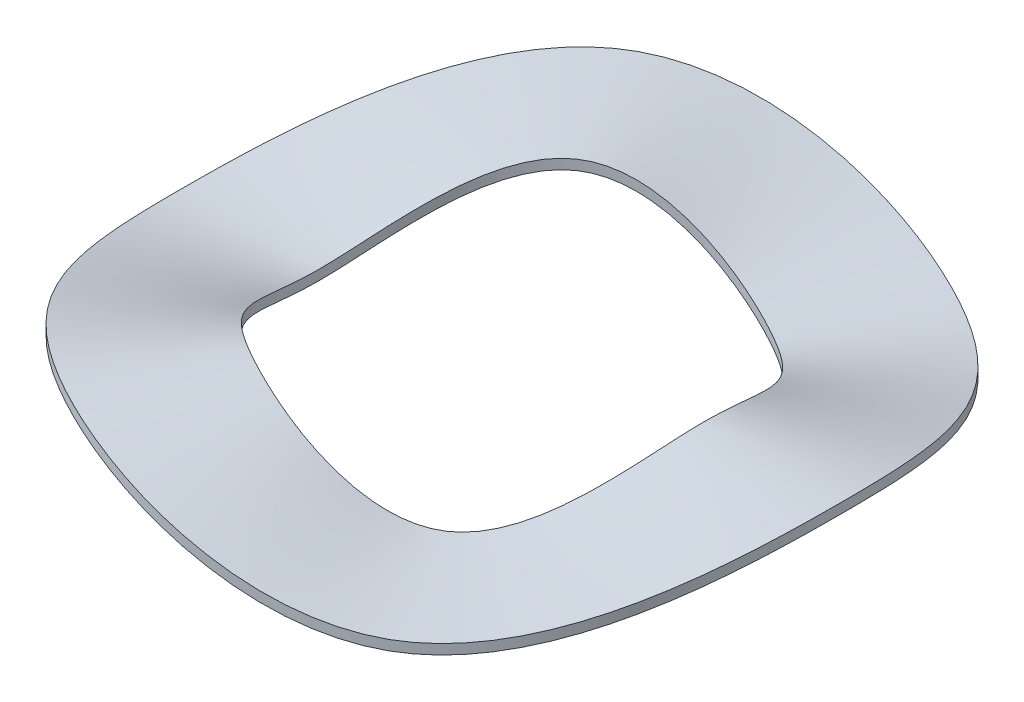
ISO-10303-21;
HEADER;
FILE_DESCRIPTION(('STEP AP214'),'2;1');
FILE_NAME('part.step','',(''),(''),'','','');
FILE_SCHEMA(('AUTOMOTIVE_DESIGN { 1 0 10303 214 1 1 1 1 }'));
ENDSEC;
DATA;
#1=APPLICATION_CONTEXT('core data for automotive mechanical design processes');
#2=APPLICATION_PROTOCOL_DEFINITION('international standard','automotive_design',2000,#1);
#3=PRODUCT_CONTEXT('',#1,'mechanical');
#4=PRODUCT('Part','Part','',(#3));
#5=PRODUCT_RELATED_PRODUCT_CATEGORY('part','',(#4));
#6=PRODUCT_DEFINITION_FORMATION('','',#4);
#7=PRODUCT_DEFINITION_CONTEXT('part definition',#1,'design');
#8=PRODUCT_DEFINITION('design','',#6,#7);
#9=PRODUCT_DEFINITION_SHAPE('','',#8);
#10=(LENGTH_UNIT() NAMED_UNIT(*) SI_UNIT(.MILLI.,.METRE.));
#11=(NAMED_UNIT(*) PLANE_ANGLE_UNIT() SI_UNIT($,.RADIAN.));
#12=(NAMED_UNIT(*) SI_UNIT($,.STERADIAN.) SOLID_ANGLE_UNIT());
#13=UNCERTAINTY_MEASURE_WITH_UNIT(LENGTH_MEASURE(1.E-05),#10,'distance_accuracy_value','');
#14=(GEOMETRIC_REPRESENTATION_CONTEXT(3) GLOBAL_UNCERTAINTY_ASSIGNED_CONTEXT((#13)) GLOBAL_UNIT_ASSIGNED_CONTEXT((#10,
#11,#12)) REPRESENTATION_CONTEXT('',''));
#15=CARTESIAN_POINT('',(0.,0.,0.));
#16=DIRECTION('',(0.,0.,1.));
#17=DIRECTION('',(1.,0.,0.));
#18=AXIS2_PLACEMENT_3D('',#15,#16,#17);
#19=CARTESIAN_POINT('',(-12.6365,0.381,0.));
#20=CARTESIAN_POINT('',(-12.636499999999,0.380999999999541,-0.218870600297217));
#21=CARTESIAN_POINT('',(-12.6238634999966,0.392302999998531,-0.656611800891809));
#22=CARTESIAN_POINT('',(-12.5679469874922,0.439775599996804,-1.31158207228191));
#23=CARTESIAN_POINT('',(-12.4760164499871,0.514375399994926,-1.96326928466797));
#24=CARTESIAN_POINT('',(-11.7140354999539,1.10439199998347,-5.84384502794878));
#25=CARTESIAN_POINT('',(-6.570979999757,4.45008000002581,-13.13223601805));
#26=CARTESIAN_POINT('',(7.58189999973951,-1.87960000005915,-13.1322360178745));
#27=CARTESIAN_POINT('',(15.163800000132,4.90219999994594,-6.70400177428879E-10));
#28=CARTESIAN_POINT('',(7.5818999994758,-1.87959999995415,13.1322360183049));
#29=CARTESIAN_POINT('',(-6.57097999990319,4.45008000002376,13.1322360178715));
#30=CARTESIAN_POINT('',(-11.7140355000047,1.10439200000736,5.8438450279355));
#31=CARTESIAN_POINT('',(-12.4760164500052,0.514375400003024,1.96326928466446));
#32=CARTESIAN_POINT('',(-12.5679469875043,0.439775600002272,1.31158207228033));
#33=CARTESIAN_POINT('',(-12.6238635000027,0.392303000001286,0.6566118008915));
#34=CARTESIAN_POINT('',(-12.636500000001,0.381000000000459,0.218870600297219));
#35=CARTESIAN_POINT('',(-12.6365,0.381,0.));
#36=CARTESIAN_POINT('',(-10.8712,0.381,0.));
#37=CARTESIAN_POINT('',(-10.8711999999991,0.380999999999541,-0.188294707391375));
#38=CARTESIAN_POINT('',(-10.8603287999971,0.392302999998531,-0.56488412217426));
#39=CARTESIAN_POINT('',(-10.8122237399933,0.439775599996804,-1.12835603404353));
#40=CARTESIAN_POINT('',(-10.7331357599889,0.514375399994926,-1.68900352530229));
#41=CARTESIAN_POINT('',(-10.0776023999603,1.10439199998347,-5.02746868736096));
#42=CARTESIAN_POINT('',(-5.65302399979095,4.45008000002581,-11.2976824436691));
#43=CARTESIAN_POINT('',(6.5227199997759,-1.87960000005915,-11.2976824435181));
#44=CARTESIAN_POINT('',(13.0454400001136,4.90219999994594,-5.76746305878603E-10));
#45=CARTESIAN_POINT('',(6.52271999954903,-1.87959999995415,11.2976824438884));
#46=CARTESIAN_POINT('',(-5.65302399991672,4.45008000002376,11.2976824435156));
#47=CARTESIAN_POINT('',(-10.077602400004,1.10439200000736,5.02746868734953));
#48=CARTESIAN_POINT('',(-10.7331357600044,0.514375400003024,1.68900352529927));
#49=CARTESIAN_POINT('',(-10.8122237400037,0.439775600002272,1.12835603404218));
#50=CARTESIAN_POINT('',(-10.8603288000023,0.392303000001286,0.564884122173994));
#51=CARTESIAN_POINT('',(-10.8712000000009,0.381000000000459,0.188294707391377));
#52=CARTESIAN_POINT('',(-10.8712,0.381,0.));
#53=CARTESIAN_POINT('',(-9.1059,0.381,0.));
#54=CARTESIAN_POINT('',(-9.10589999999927,0.380999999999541,-0.157718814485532));
#55=CARTESIAN_POINT('',(-9.09679409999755,0.392302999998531,-0.47315644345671));
#56=CARTESIAN_POINT('',(-9.05650049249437,0.439775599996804,-0.945129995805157));
#57=CARTESIAN_POINT('',(-8.99025506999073,0.514375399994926,-1.41473776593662));
#58=CARTESIAN_POINT('',(-8.44116929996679,1.10439199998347,-4.21109234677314));
#59=CARTESIAN_POINT('',(-4.73506799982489,4.45008000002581,-9.46312886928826));
#60=CARTESIAN_POINT('',(5.46353999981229,-1.87960000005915,-9.46312886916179));
#61=CARTESIAN_POINT('',(10.9270800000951,4.90219999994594,-4.83094277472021E-10));
#62=CARTESIAN_POINT('',(5.46353999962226,-1.87959999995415,9.46312886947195));
#63=CARTESIAN_POINT('',(-4.73506799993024,4.45008000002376,9.46312886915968));
#64=CARTESIAN_POINT('',(-8.44116930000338,1.10439200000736,4.21109234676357));
#65=CARTESIAN_POINT('',(-8.99025507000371,0.514375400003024,1.41473776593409));
#66=CARTESIAN_POINT('',(-9.05650049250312,0.439775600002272,0.94512999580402));
#67=CARTESIAN_POINT('',(-9.09679410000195,0.392303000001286,0.473156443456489));
#68=CARTESIAN_POINT('',(-9.10590000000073,0.381000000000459,0.157718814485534));
#69=CARTESIAN_POINT('',(-9.1059,0.381,0.));
#70=CARTESIAN_POINT('',(-7.3406,0.381,0.));
#71=CARTESIAN_POINT('',(-7.34059999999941,0.380999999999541,-0.127142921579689));
#72=CARTESIAN_POINT('',(-7.33325939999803,0.392302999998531,-0.381428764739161));
#73=CARTESIAN_POINT('',(-7.30077724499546,0.439775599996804,-0.761903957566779));
#74=CARTESIAN_POINT('',(-7.24737437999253,0.514375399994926,-1.14047200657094));
#75=CARTESIAN_POINT('',(-6.80473619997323,1.10439199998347,-3.39471600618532));
#76=CARTESIAN_POINT('',(-3.81711199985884,4.45008000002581,-7.62857529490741));
#77=CARTESIAN_POINT('',(4.40435999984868,-1.87960000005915,-7.62857529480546));
#78=CARTESIAN_POINT('',(8.80872000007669,4.90219999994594,-3.89440053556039E-10));
#79=CARTESIAN_POINT('',(4.40435999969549,-1.87959999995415,7.62857529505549));
#80=CARTESIAN_POINT('',(-3.81711199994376,4.45008000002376,7.62857529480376));
#81=CARTESIAN_POINT('',(-6.80473620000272,1.10439200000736,3.3947160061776));
#82=CARTESIAN_POINT('',(-7.247374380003,0.514375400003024,1.1404720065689));
#83=CARTESIAN_POINT('',(-7.30077724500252,0.439775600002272,0.761903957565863));
#84=CARTESIAN_POINT('',(-7.33325940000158,0.392303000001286,0.381428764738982));
#85=CARTESIAN_POINT('',(-7.3406000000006,0.381000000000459,0.127142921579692));
#86=CARTESIAN_POINT('',(-7.3406,0.381,0.));
#87=B_SPLINE_SURFACE_WITH_KNOTS('',3,3,((#19,#20,#21,#22,#23,#24,#25,#26,#27,#28,#29,#30,#31,
#32,#33,#34,#35),(#36,#37,#38,#39,#40,#41,#42,#43,#44,#45,#46,#47,#48,#49,#50,#51,#52),(#53,#54,
#55,#56,#57,#58,#59,#60,#61,#62,#63,#64,#65,#66,#67,#68,#69),(#70,#71,#72,#73,#74,#75,#76,#77,
#78,#79,#80,#81,#82,#83,#84,#85,#86)),.UNSPECIFIED.,.F.,.T.,.F.,(4,4),(4,1,1,1,1,1,1,1,1,1,1,1,
1,1,4),(0.,1.),(0.,0.0083333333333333,0.0166666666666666,0.0250000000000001,0.0333333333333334,
0.166666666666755,0.333333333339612,0.500000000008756,0.666666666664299,0.833333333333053,
0.966666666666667,0.975,0.983333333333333,0.991666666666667,1.),.UNSPECIFIED.);
#88=CARTESIAN_POINT('',(-12.6365,0.381,0.));
#89=CARTESIAN_POINT('',(-12.636499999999,0.380999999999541,-0.218870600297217));
#90=CARTESIAN_POINT('',(-12.6238634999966,0.392302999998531,-0.656611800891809));
#91=CARTESIAN_POINT('',(-12.5679469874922,0.439775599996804,-1.31158207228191));
#92=CARTESIAN_POINT('',(-12.4760164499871,0.514375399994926,-1.96326928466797));
#93=CARTESIAN_POINT('',(-11.7140354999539,1.10439199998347,-5.84384502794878));
#94=CARTESIAN_POINT('',(-6.570979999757,4.45008000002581,-13.13223601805));
#95=CARTESIAN_POINT('',(7.58189999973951,-1.87960000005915,-13.1322360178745));
#96=CARTESIAN_POINT('',(15.163800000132,4.90219999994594,-6.70400177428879E-10));
#97=CARTESIAN_POINT('',(7.5818999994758,-1.87959999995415,13.1322360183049));
#98=CARTESIAN_POINT('',(-6.57097999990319,4.45008000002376,13.1322360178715));
#99=CARTESIAN_POINT('',(-11.7140355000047,1.10439200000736,5.8438450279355));
#100=CARTESIAN_POINT('',(-12.4760164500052,0.514375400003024,1.96326928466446));
#101=CARTESIAN_POINT('',(-12.5679469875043,0.439775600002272,1.31158207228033));
#102=CARTESIAN_POINT('',(-12.6238635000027,0.392303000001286,0.6566118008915));
#103=CARTESIAN_POINT('',(-12.636500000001,0.381000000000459,0.218870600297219));
#104=CARTESIAN_POINT('',(-12.6365,0.381,0.));
#105=B_SPLINE_CURVE_WITH_KNOTS('',3,(#88,#89,#90,#91,#92,#93,#94,#95,#96,#97,#98,#99,#100,#101,
#102,#103,#104),.UNSPECIFIED.,.T.,.F.,(4,1,1,1,1,1,1,1,1,1,1,1,1,1,4),(0.,0.0083333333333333,
0.0166666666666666,0.0250000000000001,0.0333333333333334,0.166666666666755,0.333333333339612,
0.500000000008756,0.666666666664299,0.833333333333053,0.966666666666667,0.975,0.983333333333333,
0.991666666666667,1.),.UNSPECIFIED.);
#106=CARTESIAN_POINT('',(-12.6365,0.381,0.));
#107=VERTEX_POINT('',#106);
#108=EDGE_CURVE('E11',#107,#107,#105,.F.);
#109=CARTESIAN_POINT('',(-7.3406,0.381,0.));
#110=CARTESIAN_POINT('',(-7.34059999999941,0.380999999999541,-0.127142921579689));
#111=CARTESIAN_POINT('',(-7.33325939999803,0.392302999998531,-0.381428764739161));
#112=CARTESIAN_POINT('',(-7.30077724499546,0.439775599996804,-0.761903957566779));
#113=CARTESIAN_POINT('',(-7.24737437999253,0.514375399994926,-1.14047200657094));
#114=CARTESIAN_POINT('',(-6.80473619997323,1.10439199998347,-3.39471600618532));
#115=CARTESIAN_POINT('',(-3.81711199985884,4.45008000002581,-7.62857529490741));
#116=CARTESIAN_POINT('',(4.40435999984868,-1.87960000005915,-7.62857529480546));
#117=CARTESIAN_POINT('',(8.80872000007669,4.90219999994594,-3.89440053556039E-10));
#118=CARTESIAN_POINT('',(4.40435999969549,-1.87959999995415,7.62857529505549));
#119=CARTESIAN_POINT('',(-3.81711199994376,4.45008000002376,7.62857529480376));
#120=CARTESIAN_POINT('',(-6.80473620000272,1.10439200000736,3.3947160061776));
#121=CARTESIAN_POINT('',(-7.247374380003,0.514375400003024,1.1404720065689));
#122=CARTESIAN_POINT('',(-7.30077724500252,0.439775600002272,0.761903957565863));
#123=CARTESIAN_POINT('',(-7.33325940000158,0.392303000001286,0.381428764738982));
#124=CARTESIAN_POINT('',(-7.3406000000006,0.381000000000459,0.127142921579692));
#125=CARTESIAN_POINT('',(-7.3406,0.381,0.));
#126=B_SPLINE_CURVE_WITH_KNOTS('',3,(#109,#110,#111,#112,#113,#114,#115,#116,#117,#118,#119,
#120,#121,#122,#123,#124,#125),.UNSPECIFIED.,.T.,.F.,(4,1,1,1,1,1,1,1,1,1,1,1,1,1,4),(0.,
0.0083333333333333,0.0166666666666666,0.0250000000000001,0.0333333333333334,0.166666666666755,
0.333333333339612,0.500000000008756,0.666666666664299,0.833333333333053,0.966666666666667,0.975,
0.983333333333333,0.991666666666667,1.),.UNSPECIFIED.);
#127=CARTESIAN_POINT('',(-7.3406,0.381,0.));
#128=VERTEX_POINT('',#127);
#129=EDGE_CURVE('E63',#128,#128,#126,.T.);
#130=ORIENTED_EDGE('',*,*,#108,.T.);
#131=EDGE_LOOP('',(#130));
#132=FACE_BOUND('',#131,.T.);
#133=ORIENTED_EDGE('',*,*,#129,.T.);
#134=EDGE_LOOP('',(#133));
#135=FACE_BOUND('',#134,.T.);
#136=ADVANCED_FACE('F51',(#132,#135),#87,.T.);
#137=CARTESIAN_POINT('',(-12.6365,0.,0.));
#138=CARTESIAN_POINT('',(-12.636499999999,-4.59229076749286E-13,-0.218870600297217));
#139=CARTESIAN_POINT('',(-12.6238634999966,0.0113029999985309,-0.656611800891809));
#140=CARTESIAN_POINT('',(-12.5679469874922,0.0587755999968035,-1.31158207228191));
#141=CARTESIAN_POINT('',(-12.4760164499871,0.133375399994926,-1.96326928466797));
#142=CARTESIAN_POINT('',(-11.7140354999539,0.723391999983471,-5.84384502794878));
#143=CARTESIAN_POINT('',(-6.570979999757,4.06908000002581,-13.13223601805));
#144=CARTESIAN_POINT('',(7.58189999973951,-2.26060000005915,-13.1322360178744));
#145=CARTESIAN_POINT('',(15.163800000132,4.52119999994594,-6.70402264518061E-10));
#146=CARTESIAN_POINT('',(7.58189999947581,-2.26059999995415,13.1322360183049));
#147=CARTESIAN_POINT('',(-6.57097999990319,4.06908000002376,13.1322360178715));
#148=CARTESIAN_POINT('',(-11.7140355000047,0.723392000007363,5.8438450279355));
#149=CARTESIAN_POINT('',(-12.4760164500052,0.133375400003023,1.96326928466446));
#150=CARTESIAN_POINT('',(-12.5679469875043,0.0587756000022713,1.31158207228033));
#151=CARTESIAN_POINT('',(-12.6238635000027,0.0113030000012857,0.6566118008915));
#152=CARTESIAN_POINT('',(-12.636500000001,4.5902409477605E-13,0.218870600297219));
#153=CARTESIAN_POINT('',(-12.6365,0.,0.));
#154=CARTESIAN_POINT('',(-12.6365,0.03175,0.));
#155=CARTESIAN_POINT('',(-12.636499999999,0.0317499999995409,-0.218870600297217));
#156=CARTESIAN_POINT('',(-12.6238634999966,0.043052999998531,-0.656611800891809));
#157=CARTESIAN_POINT('',(-12.5679469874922,0.0905255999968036,-1.31158207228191));
#158=CARTESIAN_POINT('',(-12.4760164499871,0.165125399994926,-1.96326928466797));
#159=CARTESIAN_POINT('',(-11.7140354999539,0.755141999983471,-5.84384502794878));
#160=CARTESIAN_POINT('',(-6.570979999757,4.10083000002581,-13.13223601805));
#161=CARTESIAN_POINT('',(7.5818999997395,-2.22885000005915,-13.1322360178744));
#162=CARTESIAN_POINT('',(15.163800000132,4.55294999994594,-6.70402264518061E-10));
#163=CARTESIAN_POINT('',(7.5818999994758,-2.22884999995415,13.1322360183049));
#164=CARTESIAN_POINT('',(-6.57097999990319,4.10083000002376,13.1322360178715));
#165=CARTESIAN_POINT('',(-11.7140355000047,0.755142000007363,5.8438450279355));
#166=CARTESIAN_POINT('',(-12.4760164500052,0.165125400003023,1.96326928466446));
#167=CARTESIAN_POINT('',(-12.5679469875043,0.0905256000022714,1.31158207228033));
#168=CARTESIAN_POINT('',(-12.6238635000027,0.0430530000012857,0.6566118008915));
#169=CARTESIAN_POINT('',(-12.636500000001,0.0317500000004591,0.218870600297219));
#170=CARTESIAN_POINT('',(-12.6365,0.03175,0.));
#171=CARTESIAN_POINT('',(-12.6365,0.0952500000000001,0.));
#172=CARTESIAN_POINT('',(-12.636499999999,0.095249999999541,-0.218870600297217));
#173=CARTESIAN_POINT('',(-12.6238634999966,0.106552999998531,-0.656611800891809));
#174=CARTESIAN_POINT('',(-12.5679469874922,0.154025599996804,-1.31158207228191));
#175=CARTESIAN_POINT('',(-12.4760164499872,0.228625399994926,-1.96326928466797));
#176=CARTESIAN_POINT('',(-11.7140354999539,0.818641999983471,-5.84384502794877));
#177=CARTESIAN_POINT('',(-6.570979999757,4.16433000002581,-13.1322360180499));
#178=CARTESIAN_POINT('',(7.58189999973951,-2.16535000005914,-13.1322360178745));
#179=CARTESIAN_POINT('',(15.163800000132,4.61644999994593,-6.70398632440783E-10));
#180=CARTESIAN_POINT('',(7.58189999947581,-2.16534999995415,13.1322360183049));
#181=CARTESIAN_POINT('',(-6.5709799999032,4.16433000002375,13.1322360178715));
#182=CARTESIAN_POINT('',(-11.7140355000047,0.818642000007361,5.8438450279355));
#183=CARTESIAN_POINT('',(-12.4760164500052,0.228625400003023,1.96326928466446));
#184=CARTESIAN_POINT('',(-12.5679469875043,0.154025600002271,1.31158207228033));
#185=CARTESIAN_POINT('',(-12.6238635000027,0.106553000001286,0.6566118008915));
#186=CARTESIAN_POINT('',(-12.636500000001,0.0952500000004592,0.218870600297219));
#187=CARTESIAN_POINT('',(-12.6365,0.0952500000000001,0.));
#188=CARTESIAN_POINT('',(-12.6365,0.1905,0.));
#189=CARTESIAN_POINT('',(-12.636499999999,0.190499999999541,-0.218870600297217));
#190=CARTESIAN_POINT('',(-12.6238634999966,0.201802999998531,-0.656611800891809));
#191=CARTESIAN_POINT('',(-12.5679469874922,0.249275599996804,-1.31158207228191));
#192=CARTESIAN_POINT('',(-12.4760164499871,0.323875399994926,-1.96326928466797));
#193=CARTESIAN_POINT('',(-11.7140354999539,0.913891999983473,-5.84384502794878));
#194=CARTESIAN_POINT('',(-6.570979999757,4.25958000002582,-13.13223601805));
#195=CARTESIAN_POINT('',(7.5818999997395,-2.07010000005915,-13.1322360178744));
#196=CARTESIAN_POINT('',(15.163800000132,4.71169999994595,-6.70400949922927E-10));
#197=CARTESIAN_POINT('',(7.5818999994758,-2.07009999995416,13.1322360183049));
#198=CARTESIAN_POINT('',(-6.57097999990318,4.25958000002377,13.1322360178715));
#199=CARTESIAN_POINT('',(-11.7140355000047,0.913892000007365,5.8438450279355));
#200=CARTESIAN_POINT('',(-12.4760164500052,0.323875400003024,1.96326928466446));
#201=CARTESIAN_POINT('',(-12.5679469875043,0.249275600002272,1.31158207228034));
#202=CARTESIAN_POINT('',(-12.6238635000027,0.201803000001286,0.656611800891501));
#203=CARTESIAN_POINT('',(-12.636500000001,0.190500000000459,0.21887060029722));
#204=CARTESIAN_POINT('',(-12.6365,0.1905,0.));
#205=CARTESIAN_POINT('',(-12.6365,0.28575,0.));
#206=CARTESIAN_POINT('',(-12.636499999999,0.285749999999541,-0.218870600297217));
#207=CARTESIAN_POINT('',(-12.6238634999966,0.297052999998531,-0.656611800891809));
#208=CARTESIAN_POINT('',(-12.5679469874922,0.344525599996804,-1.31158207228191));
#209=CARTESIAN_POINT('',(-12.4760164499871,0.419125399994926,-1.96326928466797));
#210=CARTESIAN_POINT('',(-11.7140354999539,1.00914199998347,-5.84384502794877));
#211=CARTESIAN_POINT('',(-6.57097999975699,4.3548300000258,-13.13223601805));
#212=CARTESIAN_POINT('',(7.58189999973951,-1.97485000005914,-13.1322360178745));
#213=CARTESIAN_POINT('',(15.163800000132,4.80694999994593,-6.70398795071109E-10));
#214=CARTESIAN_POINT('',(7.58189999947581,-1.97484999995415,13.1322360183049));
#215=CARTESIAN_POINT('',(-6.5709799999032,4.35483000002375,13.1322360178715));
#216=CARTESIAN_POINT('',(-11.7140355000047,1.00914200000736,5.84384502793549));
#217=CARTESIAN_POINT('',(-12.4760164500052,0.419125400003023,1.96326928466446));
#218=CARTESIAN_POINT('',(-12.5679469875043,0.344525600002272,1.31158207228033));
#219=CARTESIAN_POINT('',(-12.6238635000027,0.297053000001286,0.6566118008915));
#220=CARTESIAN_POINT('',(-12.636500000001,0.285750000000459,0.218870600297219));
#221=CARTESIAN_POINT('',(-12.6365,0.28575,0.));
#222=CARTESIAN_POINT('',(-12.6365,0.34925,0.));
#223=CARTESIAN_POINT('',(-12.636499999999,0.349249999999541,-0.218870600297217));
#224=CARTESIAN_POINT('',(-12.6238634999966,0.360552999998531,-0.656611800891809));
#225=CARTESIAN_POINT('',(-12.5679469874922,0.408025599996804,-1.31158207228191));
#226=CARTESIAN_POINT('',(-12.4760164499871,0.482625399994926,-1.96326928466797));
#227=CARTESIAN_POINT('',(-11.7140354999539,1.07264199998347,-5.84384502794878));
#228=CARTESIAN_POINT('',(-6.570979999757,4.41833000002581,-13.13223601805));
#229=CARTESIAN_POINT('',(7.58189999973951,-1.91135000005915,-13.1322360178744));
#230=CARTESIAN_POINT('',(15.163800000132,4.87044999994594,-6.70400868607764E-10));
#231=CARTESIAN_POINT('',(7.5818999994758,-1.91134999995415,13.1322360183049));
#232=CARTESIAN_POINT('',(-6.57097999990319,4.41833000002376,13.1322360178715));
#233=CARTESIAN_POINT('',(-11.7140355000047,1.07264200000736,5.8438450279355));
#234=CARTESIAN_POINT('',(-12.4760164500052,0.482625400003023,1.96326928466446));
#235=CARTESIAN_POINT('',(-12.5679469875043,0.408025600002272,1.31158207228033));
#236=CARTESIAN_POINT('',(-12.6238635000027,0.360553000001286,0.6566118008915));
#237=CARTESIAN_POINT('',(-12.636500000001,0.349250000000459,0.218870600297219));
#238=CARTESIAN_POINT('',(-12.6365,0.34925,0.));
#239=CARTESIAN_POINT('',(-12.6365,0.381,0.));
#240=CARTESIAN_POINT('',(-12.636499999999,0.380999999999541,-0.218870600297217));
#241=CARTESIAN_POINT('',(-12.6238634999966,0.392302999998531,-0.656611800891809));
#242=CARTESIAN_POINT('',(-12.5679469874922,0.439775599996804,-1.31158207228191));
#243=CARTESIAN_POINT('',(-12.4760164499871,0.514375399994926,-1.96326928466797));
#244=CARTESIAN_POINT('',(-11.7140354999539,1.10439199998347,-5.84384502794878));
#245=CARTESIAN_POINT('',(-6.570979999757,4.45008000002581,-13.13223601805));
#246=CARTESIAN_POINT('',(7.58189999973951,-1.87960000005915,-13.1322360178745));
#247=CARTESIAN_POINT('',(15.163800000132,4.90219999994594,-6.70398781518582E-10));
#248=CARTESIAN_POINT('',(7.5818999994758,-1.87959999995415,13.1322360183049));
#249=CARTESIAN_POINT('',(-6.57097999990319,4.45008000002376,13.1322360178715));
#250=CARTESIAN_POINT('',(-11.7140355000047,1.10439200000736,5.8438450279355));
#251=CARTESIAN_POINT('',(-12.4760164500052,0.514375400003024,1.96326928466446));
#252=CARTESIAN_POINT('',(-12.5679469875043,0.439775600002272,1.31158207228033));
#253=CARTESIAN_POINT('',(-12.6238635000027,0.392303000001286,0.6566118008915));
#254=CARTESIAN_POINT('',(-12.636500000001,0.381000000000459,0.218870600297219));
#255=CARTESIAN_POINT('',(-12.6365,0.381,0.));
#256=B_SPLINE_SURFACE_WITH_KNOTS('',3,3,((#137,#138,#139,#140,#141,#142,#143,#144,#145,#146,
#147,#148,#149,#150,#151,#152,#153),(#154,#155,#156,#157,#158,#159,#160,#161,#162,#163,#164,
#165,#166,#167,#168,#169,#170),(#171,#172,#173,#174,#175,#176,#177,#178,#179,#180,#181,#182,
#183,#184,#185,#186,#187),(#188,#189,#190,#191,#192,#193,#194,#195,#196,#197,#198,#199,#200,
#201,#202,#203,#204),(#205,#206,#207,#208,#209,#210,#211,#212,#213,#214,#215,#216,#217,#218,
#219,#220,#221),(#222,#223,#224,#225,#226,#227,#228,#229,#230,#231,#232,#233,#234,#235,#236,
#237,#238),(#239,#240,#241,#242,#243,#244,#245,#246,#247,#248,#249,#250,#251,#252,#253,#254,
#255)),.UNSPECIFIED.,.F.,.T.,.F.,(4,1,1,1,4),(4,1,1,1,1,1,1,1,1,1,1,1,1,1,4),(0.937106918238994,
0.952830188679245,0.968553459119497,0.984276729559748,1.),(0.,0.0083333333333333,
0.0166666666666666,0.0250000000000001,0.0333333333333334,0.166666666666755,0.333333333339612,
0.500000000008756,0.666666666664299,0.833333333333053,0.966666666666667,0.975,0.983333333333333,
0.991666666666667,1.),.UNSPECIFIED.);
#257=CARTESIAN_POINT('',(-12.6365,0.,0.));
#258=CARTESIAN_POINT('',(-12.636499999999,-4.59229076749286E-13,-0.218870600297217));
#259=CARTESIAN_POINT('',(-12.6238634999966,0.0113029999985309,-0.656611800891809));
#260=CARTESIAN_POINT('',(-12.5679469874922,0.0587755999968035,-1.31158207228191));
#261=CARTESIAN_POINT('',(-12.4760164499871,0.133375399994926,-1.96326928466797));
#262=CARTESIAN_POINT('',(-11.7140354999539,0.723391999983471,-5.84384502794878));
#263=CARTESIAN_POINT('',(-6.570979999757,4.06908000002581,-13.13223601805));
#264=CARTESIAN_POINT('',(7.58189999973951,-2.26060000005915,-13.1322360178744));
#265=CARTESIAN_POINT('',(15.163800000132,4.52119999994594,-6.70402264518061E-10));
#266=CARTESIAN_POINT('',(7.58189999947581,-2.26059999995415,13.1322360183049));
#267=CARTESIAN_POINT('',(-6.57097999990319,4.06908000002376,13.1322360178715));
#268=CARTESIAN_POINT('',(-11.7140355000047,0.723392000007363,5.8438450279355));
#269=CARTESIAN_POINT('',(-12.4760164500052,0.133375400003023,1.96326928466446));
#270=CARTESIAN_POINT('',(-12.5679469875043,0.0587756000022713,1.31158207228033));
#271=CARTESIAN_POINT('',(-12.6238635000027,0.0113030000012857,0.6566118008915));
#272=CARTESIAN_POINT('',(-12.636500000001,4.5902409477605E-13,0.218870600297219));
#273=CARTESIAN_POINT('',(-12.6365,0.,0.));
#274=B_SPLINE_CURVE_WITH_KNOTS('',3,(#257,#258,#259,#260,#261,#262,#263,#264,#265,#266,#267,
#268,#269,#270,#271,#272,#273),.UNSPECIFIED.,.T.,.F.,(4,1,1,1,1,1,1,1,1,1,1,1,1,1,4),(0.,
0.0083333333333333,0.0166666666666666,0.0250000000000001,0.0333333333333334,0.166666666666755,
0.333333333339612,0.500000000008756,0.666666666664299,0.833333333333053,0.966666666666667,0.975,
0.983333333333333,0.991666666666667,1.),.UNSPECIFIED.);
#275=CARTESIAN_POINT('',(-12.6365,0.,0.));
#276=VERTEX_POINT('',#275);
#277=EDGE_CURVE('E57',#276,#276,#274,.T.);
#278=ORIENTED_EDGE('',*,*,#108,.F.);
#279=EDGE_LOOP('',(#278));
#280=FACE_BOUND('',#279,.T.);
#281=ORIENTED_EDGE('',*,*,#277,.F.);
#282=EDGE_LOOP('',(#281));
#283=FACE_BOUND('',#282,.T.);
#284=ADVANCED_FACE('F53',(#280,#283),#256,.T.);
#285=CARTESIAN_POINT('',(-7.3406,0.,0.));
#286=CARTESIAN_POINT('',(-7.34059999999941,-4.59229076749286E-13,-0.127142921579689));
#287=CARTESIAN_POINT('',(-7.33325939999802,0.0113029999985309,-0.381428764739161));
#288=CARTESIAN_POINT('',(-7.30077724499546,0.0587755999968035,-0.761903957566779));
#289=CARTESIAN_POINT('',(-7.24737437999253,0.133375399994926,-1.14047200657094));
#290=CARTESIAN_POINT('',(-6.80473619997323,0.723391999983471,-3.39471600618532));
#291=CARTESIAN_POINT('',(-3.81711199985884,4.06908000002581,-7.62857529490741));
#292=CARTESIAN_POINT('',(4.40435999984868,-2.26060000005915,-7.62857529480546));
#293=CARTESIAN_POINT('',(8.80872000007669,4.52119999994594,-3.89438962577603E-10));
#294=CARTESIAN_POINT('',(4.40435999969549,-2.26059999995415,7.62857529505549));
#295=CARTESIAN_POINT('',(-3.81711199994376,4.06908000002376,7.62857529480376));
#296=CARTESIAN_POINT('',(-6.80473620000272,0.723392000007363,3.3947160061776));
#297=CARTESIAN_POINT('',(-7.247374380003,0.133375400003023,1.1404720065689));
#298=CARTESIAN_POINT('',(-7.30077724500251,0.0587756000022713,0.761903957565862));
#299=CARTESIAN_POINT('',(-7.33325940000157,0.0113030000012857,0.381428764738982));
#300=CARTESIAN_POINT('',(-7.34060000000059,4.5902409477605E-13,0.127142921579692));
#301=CARTESIAN_POINT('',(-7.3406,0.,0.));
#302=CARTESIAN_POINT('',(-7.781925,0.,0.));
#303=CARTESIAN_POINT('',(-7.78192499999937,-4.59229076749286E-13,-0.13478689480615));
#304=CARTESIAN_POINT('',(-7.77414307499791,0.0113029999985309,-0.404360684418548));
#305=CARTESIAN_POINT('',(-7.73970805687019,0.0587755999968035,-0.807710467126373));
#306=CARTESIAN_POINT('',(-7.68309455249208,0.133375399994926,-1.20903844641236));
#307=CARTESIAN_POINT('',(-7.21384447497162,0.723391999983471,-3.59881009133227));
#308=CARTESIAN_POINT('',(-4.04660099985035,4.06908000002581,-8.08721368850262));
#309=CARTESIAN_POINT('',(4.66915499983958,-2.26060000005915,-8.08721368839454));
#310=CARTESIAN_POINT('',(9.33831000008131,4.52119999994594,-4.1285358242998E-10));
#311=CARTESIAN_POINT('',(4.66915499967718,-2.26059999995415,8.08721368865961));
#312=CARTESIAN_POINT('',(-4.04660099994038,4.06908000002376,8.08721368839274));
#313=CARTESIAN_POINT('',(-7.21384447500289,0.723392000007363,3.5988100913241));
#314=CARTESIAN_POINT('',(-7.68309455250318,0.133375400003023,1.2090384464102));
#315=CARTESIAN_POINT('',(-7.73970805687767,0.0587756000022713,0.807710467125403));
#316=CARTESIAN_POINT('',(-7.77414307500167,0.0113030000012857,0.404360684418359));
#317=CARTESIAN_POINT('',(-7.78192500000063,4.5902409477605E-13,0.134786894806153));
#318=CARTESIAN_POINT('',(-7.781925,0.,0.));
#319=CARTESIAN_POINT('',(-8.66457499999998,0.,0.));
#320=CARTESIAN_POINT('',(-8.66457499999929,-4.59229076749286E-13,-0.150074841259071));
#321=CARTESIAN_POINT('',(-8.65591042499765,0.0113029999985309,-0.450224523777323));
#322=CARTESIAN_POINT('',(-8.61756968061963,0.0587755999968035,-0.899323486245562));
#323=CARTESIAN_POINT('',(-8.55453489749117,0.133375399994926,-1.3461713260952));
#324=CARTESIAN_POINT('',(-8.03206102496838,0.723391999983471,-4.00699826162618));
#325=CARTESIAN_POINT('',(-4.50557899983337,4.06908000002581,-9.00449047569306));
#326=CARTESIAN_POINT('',(5.19874499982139,-2.26060000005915,-9.00449047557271));
#327=CARTESIAN_POINT('',(10.3974900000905,4.52119999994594,-4.59680877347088E-10));
#328=CARTESIAN_POINT('',(5.19874499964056,-2.26059999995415,9.00449047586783));
#329=CARTESIAN_POINT('',(-4.50557899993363,4.06908000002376,9.00449047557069));
#330=CARTESIAN_POINT('',(-8.0320610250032,0.723392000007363,4.00699826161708));
#331=CARTESIAN_POINT('',(-8.55453489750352,0.133375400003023,1.34617132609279));
#332=CARTESIAN_POINT('',(-8.61756968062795,0.0587756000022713,0.89932348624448));
#333=CARTESIAN_POINT('',(-8.65591042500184,0.0113030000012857,0.450224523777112));
#334=CARTESIAN_POINT('',(-8.66457500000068,4.5902409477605E-13,0.150074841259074));
#335=CARTESIAN_POINT('',(-8.66457499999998,0.,0.));
#336=CARTESIAN_POINT('',(-9.98855000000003,0.,0.));
#337=CARTESIAN_POINT('',(-9.98854999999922,-4.59125315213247E-13,-0.173006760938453));
#338=CARTESIAN_POINT('',(-9.97856144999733,0.011302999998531,-0.519020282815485));
#339=CARTESIAN_POINT('',(-9.93436211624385,0.0587755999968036,-1.03674301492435));
#340=CARTESIAN_POINT('',(-9.86169541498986,0.133375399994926,-1.55187064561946));
#341=CARTESIAN_POINT('',(-9.25938584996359,0.723391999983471,-4.61928051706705));
#342=CARTESIAN_POINT('',(-5.19404599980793,4.06908000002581,-10.3804056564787));
#343=CARTESIAN_POINT('',(5.9931299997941,-2.26060000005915,-10.38040565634));
#344=CARTESIAN_POINT('',(11.9862600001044,4.52119999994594,-5.29917879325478E-10));
#345=CARTESIAN_POINT('',(5.99312999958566,-2.26059999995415,10.3804056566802));
#346=CARTESIAN_POINT('',(-5.19404599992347,4.06908000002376,10.3804056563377));
#347=CARTESIAN_POINT('',(-9.25938585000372,0.723392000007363,4.61928051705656));
#348=CARTESIAN_POINT('',(-9.8616954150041,0.133375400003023,1.55187064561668));
#349=CARTESIAN_POINT('',(-9.93436211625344,0.0587756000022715,1.0367430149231));
#350=CARTESIAN_POINT('',(-9.97856145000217,0.0113030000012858,0.519020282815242));
#351=CARTESIAN_POINT('',(-9.98855000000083,4.59140138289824E-13,0.173006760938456));
#352=CARTESIAN_POINT('',(-9.98855000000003,0.,0.));
#353=CARTESIAN_POINT('',(-11.312525,0.,0.));
#354=CARTESIAN_POINT('',(-11.3125249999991,-4.59125315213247E-13,-0.195938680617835));
#355=CARTESIAN_POINT('',(-11.3012124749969,0.011302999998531,-0.587816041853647));
#356=CARTESIAN_POINT('',(-11.251154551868,0.0587755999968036,-1.17416254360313));
#357=CARTESIAN_POINT('',(-11.1688559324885,0.133375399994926,-1.75756996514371));
#358=CARTESIAN_POINT('',(-10.4867106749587,0.723391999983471,-5.23156277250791));
#359=CARTESIAN_POINT('',(-5.88251299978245,4.06908000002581,-11.7563208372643));
#360=CARTESIAN_POINT('',(6.78751499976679,-2.26060000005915,-11.7563208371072));
#361=CARTESIAN_POINT('',(13.5750300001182,4.52119999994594,-6.00164625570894E-10));
#362=CARTESIAN_POINT('',(6.78751499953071,-2.26059999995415,11.7563208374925));
#363=CARTESIAN_POINT('',(-5.88251299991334,4.06908000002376,11.7563208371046));
#364=CARTESIAN_POINT('',(-10.4867106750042,0.723392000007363,5.23156277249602));
#365=CARTESIAN_POINT('',(-11.1688559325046,0.133375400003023,1.75756996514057));
#366=CARTESIAN_POINT('',(-11.2511545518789,0.0587756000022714,1.17416254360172));
#367=CARTESIAN_POINT('',(-11.3012124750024,0.0113030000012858,0.587816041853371));
#368=CARTESIAN_POINT('',(-11.3125250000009,4.59134209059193E-13,0.195938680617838));
#369=CARTESIAN_POINT('',(-11.312525,0.,0.));
#370=CARTESIAN_POINT('',(-12.195175,0.,0.));
#371=CARTESIAN_POINT('',(-12.195174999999,-4.59229076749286E-13,-0.211226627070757));
#372=CARTESIAN_POINT('',(-12.1829798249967,0.0113029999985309,-0.633679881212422));
#373=CARTESIAN_POINT('',(-12.1290161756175,0.0587755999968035,-1.26577556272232));
#374=CARTESIAN_POINT('',(-12.0402962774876,0.133375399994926,-1.89470284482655));
#375=CARTESIAN_POINT('',(-11.3049272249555,0.723391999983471,-5.63975094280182));
#376=CARTESIAN_POINT('',(-6.34149099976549,4.06908000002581,-12.6735976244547));
#377=CARTESIAN_POINT('',(7.3171049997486,-2.26060000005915,-12.6735976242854));
#378=CARTESIAN_POINT('',(14.6342100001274,4.52119999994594,-6.4699013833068E-10));
#379=CARTESIAN_POINT('',(7.31710499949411,-2.26059999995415,12.6735976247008));
#380=CARTESIAN_POINT('',(-6.34149099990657,4.06908000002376,12.6735976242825));
#381=CARTESIAN_POINT('',(-11.3049272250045,0.723392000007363,5.63975094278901));
#382=CARTESIAN_POINT('',(-12.040296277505,0.133375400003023,1.89470284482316));
#383=CARTESIAN_POINT('',(-12.1290161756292,0.0587756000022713,1.26577556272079));
#384=CARTESIAN_POINT('',(-12.1829798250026,0.0113030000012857,0.633679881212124));
#385=CARTESIAN_POINT('',(-12.195175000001,4.5902409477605E-13,0.211226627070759));
#386=CARTESIAN_POINT('',(-12.195175,0.,0.));
#387=CARTESIAN_POINT('',(-12.6365,0.,0.));
#388=CARTESIAN_POINT('',(-12.636499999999,-4.59229076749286E-13,-0.218870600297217));
#389=CARTESIAN_POINT('',(-12.6238634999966,0.0113029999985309,-0.656611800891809));
#390=CARTESIAN_POINT('',(-12.5679469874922,0.0587755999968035,-1.31158207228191));
#391=CARTESIAN_POINT('',(-12.4760164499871,0.133375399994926,-1.96326928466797));
#392=CARTESIAN_POINT('',(-11.7140354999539,0.723391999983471,-5.84384502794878));
#393=CARTESIAN_POINT('',(-6.570979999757,4.06908000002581,-13.13223601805));
#394=CARTESIAN_POINT('',(7.58189999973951,-2.26060000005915,-13.1322360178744));
#395=CARTESIAN_POINT('',(15.163800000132,4.52119999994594,-6.70402264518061E-10));
#396=CARTESIAN_POINT('',(7.58189999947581,-2.26059999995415,13.1322360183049));
#397=CARTESIAN_POINT('',(-6.57097999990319,4.06908000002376,13.1322360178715));
#398=CARTESIAN_POINT('',(-11.7140355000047,0.723392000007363,5.8438450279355));
#399=CARTESIAN_POINT('',(-12.4760164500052,0.133375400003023,1.96326928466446));
#400=CARTESIAN_POINT('',(-12.5679469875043,0.0587756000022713,1.31158207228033));
#401=CARTESIAN_POINT('',(-12.6238635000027,0.0113030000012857,0.6566118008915));
#402=CARTESIAN_POINT('',(-12.636500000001,4.5902409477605E-13,0.218870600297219));
#403=CARTESIAN_POINT('',(-12.6365,0.,0.));
#404=B_SPLINE_SURFACE_WITH_KNOTS('',3,3,((#285,#286,#287,#288,#289,#290,#291,#292,#293,#294,
#295,#296,#297,#298,#299,#300,#301),(#302,#303,#304,#305,#306,#307,#308,#309,#310,#311,#312,
#313,#314,#315,#316,#317,#318),(#319,#320,#321,#322,#323,#324,#325,#326,#327,#328,#329,#330,
#331,#332,#333,#334,#335),(#336,#337,#338,#339,#340,#341,#342,#343,#344,#345,#346,#347,#348,
#349,#350,#351,#352),(#353,#354,#355,#356,#357,#358,#359,#360,#361,#362,#363,#364,#365,#366,
#367,#368,#369),(#370,#371,#372,#373,#374,#375,#376,#377,#378,#379,#380,#381,#382,#383,#384,
#385,#386),(#387,#388,#389,#390,#391,#392,#393,#394,#395,#396,#397,#398,#399,#400,#401,#402,
#403)),.UNSPECIFIED.,.F.,.T.,.F.,(4,1,1,1,4),(4,1,1,1,1,1,1,1,1,1,1,1,1,1,4),
(0.0628930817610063,0.281446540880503,0.5,0.718553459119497,0.937106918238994),(0.,
0.0083333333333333,0.0166666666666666,0.0250000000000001,0.0333333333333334,0.166666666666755,
0.333333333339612,0.500000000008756,0.666666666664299,0.833333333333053,0.966666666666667,0.975,
0.983333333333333,0.991666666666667,1.),.UNSPECIFIED.);
#405=CARTESIAN_POINT('',(-7.3406,0.,0.));
#406=CARTESIAN_POINT('',(-7.34059999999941,-4.59229076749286E-13,-0.127142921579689));
#407=CARTESIAN_POINT('',(-7.33325939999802,0.0113029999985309,-0.381428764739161));
#408=CARTESIAN_POINT('',(-7.30077724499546,0.0587755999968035,-0.761903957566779));
#409=CARTESIAN_POINT('',(-7.24737437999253,0.133375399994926,-1.14047200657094));
#410=CARTESIAN_POINT('',(-6.80473619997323,0.723391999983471,-3.39471600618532));
#411=CARTESIAN_POINT('',(-3.81711199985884,4.06908000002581,-7.62857529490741));
#412=CARTESIAN_POINT('',(4.40435999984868,-2.26060000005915,-7.62857529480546));
#413=CARTESIAN_POINT('',(8.80872000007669,4.52119999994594,-3.89438962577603E-10));
#414=CARTESIAN_POINT('',(4.40435999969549,-2.26059999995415,7.62857529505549));
#415=CARTESIAN_POINT('',(-3.81711199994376,4.06908000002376,7.62857529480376));
#416=CARTESIAN_POINT('',(-6.80473620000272,0.723392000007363,3.3947160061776));
#417=CARTESIAN_POINT('',(-7.247374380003,0.133375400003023,1.1404720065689));
#418=CARTESIAN_POINT('',(-7.30077724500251,0.0587756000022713,0.761903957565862));
#419=CARTESIAN_POINT('',(-7.33325940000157,0.0113030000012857,0.381428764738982));
#420=CARTESIAN_POINT('',(-7.34060000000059,4.5902409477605E-13,0.127142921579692));
#421=CARTESIAN_POINT('',(-7.3406,0.,0.));
#422=B_SPLINE_CURVE_WITH_KNOTS('',3,(#405,#406,#407,#408,#409,#410,#411,#412,#413,#414,#415,
#416,#417,#418,#419,#420,#421),.UNSPECIFIED.,.T.,.F.,(4,1,1,1,1,1,1,1,1,1,1,1,1,1,4),(0.,
0.0083333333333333,0.0166666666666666,0.0250000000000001,0.0333333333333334,0.166666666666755,
0.333333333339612,0.500000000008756,0.666666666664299,0.833333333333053,0.966666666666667,0.975,
0.983333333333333,0.991666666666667,1.),.UNSPECIFIED.);
#423=CARTESIAN_POINT('',(-7.3406,0.,0.));
#424=VERTEX_POINT('',#423);
#425=EDGE_CURVE('E76',#424,#424,#422,.T.);
#426=ORIENTED_EDGE('',*,*,#277,.T.);
#427=EDGE_LOOP('',(#426));
#428=FACE_BOUND('',#427,.T.);
#429=ORIENTED_EDGE('',*,*,#425,.F.);
#430=EDGE_LOOP('',(#429));
#431=FACE_BOUND('',#430,.T.);
#432=ADVANCED_FACE('F91',(#428,#431),#404,.T.);
#433=CARTESIAN_POINT('',(-7.3406,0.381,0.));
#434=CARTESIAN_POINT('',(-7.34059999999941,0.380999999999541,-0.127142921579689));
#435=CARTESIAN_POINT('',(-7.33325939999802,0.392302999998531,-0.381428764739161));
#436=CARTESIAN_POINT('',(-7.30077724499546,0.439775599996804,-0.761903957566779));
#437=CARTESIAN_POINT('',(-7.24737437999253,0.514375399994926,-1.14047200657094));
#438=CARTESIAN_POINT('',(-6.80473619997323,1.10439199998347,-3.39471600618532));
#439=CARTESIAN_POINT('',(-3.81711199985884,4.45008000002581,-7.62857529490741));
#440=CARTESIAN_POINT('',(4.40435999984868,-1.87960000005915,-7.62857529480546));
#441=CARTESIAN_POINT('',(8.80872000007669,4.90219999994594,-3.89439701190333E-10));
#442=CARTESIAN_POINT('',(4.40435999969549,-1.87959999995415,7.62857529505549));
#443=CARTESIAN_POINT('',(-3.81711199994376,4.45008000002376,7.62857529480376));
#444=CARTESIAN_POINT('',(-6.80473620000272,1.10439200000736,3.3947160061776));
#445=CARTESIAN_POINT('',(-7.247374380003,0.514375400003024,1.1404720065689));
#446=CARTESIAN_POINT('',(-7.30077724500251,0.439775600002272,0.761903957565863));
#447=CARTESIAN_POINT('',(-7.33325940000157,0.392303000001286,0.381428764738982));
#448=CARTESIAN_POINT('',(-7.34060000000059,0.381000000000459,0.127142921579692));
#449=CARTESIAN_POINT('',(-7.3406,0.381,0.));
#450=CARTESIAN_POINT('',(-7.3406,0.34925,0.));
#451=CARTESIAN_POINT('',(-7.34059999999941,0.349249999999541,-0.127142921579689));
#452=CARTESIAN_POINT('',(-7.33325939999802,0.360552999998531,-0.381428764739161));
#453=CARTESIAN_POINT('',(-7.30077724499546,0.408025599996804,-0.761903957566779));
#454=CARTESIAN_POINT('',(-7.24737437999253,0.482625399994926,-1.14047200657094));
#455=CARTESIAN_POINT('',(-6.80473619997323,1.07264199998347,-3.39471600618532));
#456=CARTESIAN_POINT('',(-3.81711199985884,4.41833000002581,-7.62857529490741));
#457=CARTESIAN_POINT('',(4.40435999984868,-1.91135000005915,-7.62857529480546));
#458=CARTESIAN_POINT('',(8.80872000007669,4.87044999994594,-3.89439701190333E-10));
#459=CARTESIAN_POINT('',(4.40435999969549,-1.91134999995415,7.62857529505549));
#460=CARTESIAN_POINT('',(-3.81711199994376,4.41833000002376,7.62857529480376));
#461=CARTESIAN_POINT('',(-6.80473620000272,1.07264200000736,3.3947160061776));
#462=CARTESIAN_POINT('',(-7.247374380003,0.482625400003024,1.1404720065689));
#463=CARTESIAN_POINT('',(-7.30077724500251,0.408025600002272,0.761903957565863));
#464=CARTESIAN_POINT('',(-7.33325940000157,0.360553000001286,0.381428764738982));
#465=CARTESIAN_POINT('',(-7.34060000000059,0.349250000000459,0.127142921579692));
#466=CARTESIAN_POINT('',(-7.3406,0.34925,0.));
#467=CARTESIAN_POINT('',(-7.34060000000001,0.285750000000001,0.));
#468=CARTESIAN_POINT('',(-7.34059999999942,0.285749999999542,-0.12714292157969));
#469=CARTESIAN_POINT('',(-7.33325939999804,0.297052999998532,-0.381428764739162));
#470=CARTESIAN_POINT('',(-7.30077724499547,0.344525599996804,-0.76190395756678));
#471=CARTESIAN_POINT('',(-7.24737437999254,0.419125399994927,-1.14047200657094));
#472=CARTESIAN_POINT('',(-6.80473619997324,1.00914199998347,-3.39471600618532));
#473=CARTESIAN_POINT('',(-3.81711199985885,4.35483000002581,-7.62857529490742));
#474=CARTESIAN_POINT('',(4.40435999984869,-1.97485000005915,-7.62857529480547));
#475=CARTESIAN_POINT('',(8.80872000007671,4.80694999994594,-3.89440561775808E-10));
#476=CARTESIAN_POINT('',(4.40435999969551,-1.97484999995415,7.6285752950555));
#477=CARTESIAN_POINT('',(-3.81711199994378,4.35483000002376,7.62857529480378));
#478=CARTESIAN_POINT('',(-6.80473620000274,1.00914200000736,3.39471600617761));
#479=CARTESIAN_POINT('',(-7.24737438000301,0.419125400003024,1.1404720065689));
#480=CARTESIAN_POINT('',(-7.30077724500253,0.344525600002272,0.761903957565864));
#481=CARTESIAN_POINT('',(-7.33325940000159,0.297053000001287,0.381428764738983));
#482=CARTESIAN_POINT('',(-7.34060000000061,0.28575000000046,0.127142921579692));
#483=CARTESIAN_POINT('',(-7.34060000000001,0.285750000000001,0.));
#484=CARTESIAN_POINT('',(-7.34059999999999,0.1905,0.));
#485=CARTESIAN_POINT('',(-7.3405999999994,0.190499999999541,-0.12714292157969));
#486=CARTESIAN_POINT('',(-7.33325939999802,0.201802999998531,-0.38142876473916));
#487=CARTESIAN_POINT('',(-7.30077724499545,0.249275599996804,-0.761903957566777));
#488=CARTESIAN_POINT('',(-7.24737437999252,0.323875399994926,-1.14047200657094));
#489=CARTESIAN_POINT('',(-6.80473619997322,0.913891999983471,-3.39471600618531));
#490=CARTESIAN_POINT('',(-3.81711199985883,4.25958000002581,-7.6285752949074));
#491=CARTESIAN_POINT('',(4.40435999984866,-2.07010000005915,-7.62857529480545));
#492=CARTESIAN_POINT('',(8.80872000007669,4.71169999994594,-3.89436326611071E-10));
#493=CARTESIAN_POINT('',(4.40435999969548,-2.07009999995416,7.62857529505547));
#494=CARTESIAN_POINT('',(-3.81711199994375,4.25958000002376,7.62857529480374));
#495=CARTESIAN_POINT('',(-6.80473620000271,0.913892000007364,3.3947160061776));
#496=CARTESIAN_POINT('',(-7.24737438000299,0.323875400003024,1.1404720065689));
#497=CARTESIAN_POINT('',(-7.30077724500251,0.249275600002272,0.761903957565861));
#498=CARTESIAN_POINT('',(-7.33325940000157,0.201803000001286,0.381428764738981));
#499=CARTESIAN_POINT('',(-7.34060000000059,0.190500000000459,0.127142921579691));
#500=CARTESIAN_POINT('',(-7.34059999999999,0.1905,0.));
#501=CARTESIAN_POINT('',(-7.34060000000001,0.0952500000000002,0.));
#502=CARTESIAN_POINT('',(-7.34059999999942,0.095249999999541,-0.12714292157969));
#503=CARTESIAN_POINT('',(-7.33325939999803,0.106552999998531,-0.381428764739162));
#504=CARTESIAN_POINT('',(-7.30077724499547,0.154025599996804,-0.76190395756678));
#505=CARTESIAN_POINT('',(-7.24737437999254,0.228625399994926,-1.14047200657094));
#506=CARTESIAN_POINT('',(-6.80473619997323,0.818641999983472,-3.39471600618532));
#507=CARTESIAN_POINT('',(-3.81711199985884,4.16433000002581,-7.62857529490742));
#508=CARTESIAN_POINT('',(4.40435999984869,-2.16535000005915,-7.62857529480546));
#509=CARTESIAN_POINT('',(8.8087200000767,4.61644999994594,-3.89441673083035E-10));
#510=CARTESIAN_POINT('',(4.4043599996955,-2.16534999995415,7.62857529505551));
#511=CARTESIAN_POINT('',(-3.81711199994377,4.16433000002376,7.62857529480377));
#512=CARTESIAN_POINT('',(-6.80473620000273,0.818642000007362,3.39471600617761));
#513=CARTESIAN_POINT('',(-7.247374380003,0.228625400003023,1.1404720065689));
#514=CARTESIAN_POINT('',(-7.30077724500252,0.154025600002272,0.761903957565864));
#515=CARTESIAN_POINT('',(-7.33325940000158,0.106553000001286,0.381428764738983));
#516=CARTESIAN_POINT('',(-7.3406000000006,0.0952500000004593,0.127142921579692));
#517=CARTESIAN_POINT('',(-7.34060000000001,0.0952500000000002,0.));
#518=CARTESIAN_POINT('',(-7.3406,0.03175,0.));
#519=CARTESIAN_POINT('',(-7.34059999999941,0.0317499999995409,-0.127142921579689));
#520=CARTESIAN_POINT('',(-7.33325939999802,0.043052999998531,-0.381428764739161));
#521=CARTESIAN_POINT('',(-7.30077724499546,0.0905255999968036,-0.761903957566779));
#522=CARTESIAN_POINT('',(-7.24737437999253,0.165125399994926,-1.14047200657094));
#523=CARTESIAN_POINT('',(-6.80473619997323,0.755141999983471,-3.39471600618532));
#524=CARTESIAN_POINT('',(-3.81711199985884,4.10083000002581,-7.62857529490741));
#525=CARTESIAN_POINT('',(4.40435999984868,-2.22885000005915,-7.62857529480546));
#526=CARTESIAN_POINT('',(8.8087200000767,4.55294999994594,-3.89439660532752E-10));
#527=CARTESIAN_POINT('',(4.40435999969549,-2.22884999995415,7.62857529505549));
#528=CARTESIAN_POINT('',(-3.81711199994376,4.10083000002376,7.62857529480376));
#529=CARTESIAN_POINT('',(-6.80473620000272,0.755142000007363,3.3947160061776));
#530=CARTESIAN_POINT('',(-7.247374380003,0.165125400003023,1.1404720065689));
#531=CARTESIAN_POINT('',(-7.30077724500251,0.0905256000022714,0.761903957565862));
#532=CARTESIAN_POINT('',(-7.33325940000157,0.0430530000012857,0.381428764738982));
#533=CARTESIAN_POINT('',(-7.34060000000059,0.0317500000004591,0.127142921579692));
#534=CARTESIAN_POINT('',(-7.3406,0.03175,0.));
#535=CARTESIAN_POINT('',(-7.3406,0.,0.));
#536=CARTESIAN_POINT('',(-7.34059999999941,-4.59229076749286E-13,-0.127142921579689));
#537=CARTESIAN_POINT('',(-7.33325939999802,0.0113029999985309,-0.381428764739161));
#538=CARTESIAN_POINT('',(-7.30077724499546,0.0587755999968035,-0.761903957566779));
#539=CARTESIAN_POINT('',(-7.24737437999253,0.133375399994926,-1.14047200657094));
#540=CARTESIAN_POINT('',(-6.80473619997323,0.723391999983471,-3.39471600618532));
#541=CARTESIAN_POINT('',(-3.81711199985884,4.06908000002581,-7.62857529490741));
#542=CARTESIAN_POINT('',(4.40435999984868,-2.26060000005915,-7.62857529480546));
#543=CARTESIAN_POINT('',(8.80872000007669,4.52119999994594,-3.89438962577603E-10));
#544=CARTESIAN_POINT('',(4.40435999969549,-2.26059999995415,7.62857529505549));
#545=CARTESIAN_POINT('',(-3.81711199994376,4.06908000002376,7.62857529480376));
#546=CARTESIAN_POINT('',(-6.80473620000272,0.723392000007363,3.3947160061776));
#547=CARTESIAN_POINT('',(-7.247374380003,0.133375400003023,1.1404720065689));
#548=CARTESIAN_POINT('',(-7.30077724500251,0.0587756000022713,0.761903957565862));
#549=CARTESIAN_POINT('',(-7.33325940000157,0.0113030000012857,0.381428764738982));
#550=CARTESIAN_POINT('',(-7.34060000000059,4.5902409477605E-13,0.127142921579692));
#551=CARTESIAN_POINT('',(-7.3406,0.,0.));
#552=B_SPLINE_SURFACE_WITH_KNOTS('',3,3,((#433,#434,#435,#436,#437,#438,#439,#440,#441,#442,
#443,#444,#445,#446,#447,#448,#449),(#450,#451,#452,#453,#454,#455,#456,#457,#458,#459,#460,
#461,#462,#463,#464,#465,#466),(#467,#468,#469,#470,#471,#472,#473,#474,#475,#476,#477,#478,
#479,#480,#481,#482,#483),(#484,#485,#486,#487,#488,#489,#490,#491,#492,#493,#494,#495,#496,
#497,#498,#499,#500),(#501,#502,#503,#504,#505,#506,#507,#508,#509,#510,#511,#512,#513,#514,
#515,#516,#517),(#518,#519,#520,#521,#522,#523,#524,#525,#526,#527,#528,#529,#530,#531,#532,
#533,#534),(#535,#536,#537,#538,#539,#540,#541,#542,#543,#544,#545,#546,#547,#548,#549,#550,
#551)),.UNSPECIFIED.,.F.,.T.,.F.,(4,1,1,1,4),(4,1,1,1,1,1,1,1,1,1,1,1,1,1,4),(0.,
0.0157232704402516,0.0314465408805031,0.0471698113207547,0.0628930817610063),(0.,
0.0083333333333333,0.0166666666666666,0.0250000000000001,0.0333333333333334,0.166666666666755,
0.333333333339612,0.500000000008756,0.666666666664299,0.833333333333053,0.966666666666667,0.975,
0.983333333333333,0.991666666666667,1.),.UNSPECIFIED.);
#553=ORIENTED_EDGE('',*,*,#425,.T.);
#554=EDGE_LOOP('',(#553));
#555=FACE_BOUND('',#554,.T.);
#556=ORIENTED_EDGE('',*,*,#129,.F.);
#557=EDGE_LOOP('',(#556));
#558=FACE_BOUND('',#557,.T.);
#559=ADVANCED_FACE('F100',(#555,#558),#552,.T.);
#560=CLOSED_SHELL('',(#136,#284,#432,#559));
#561=MANIFOLD_SOLID_BREP('B2',#560);
#562=ADVANCED_BREP_SHAPE_REPRESENTATION('',(#18,#561),#14);
#563=SHAPE_DEFINITION_REPRESENTATION(#9,#562);
ENDSEC;
END-ISO-10303-21;
